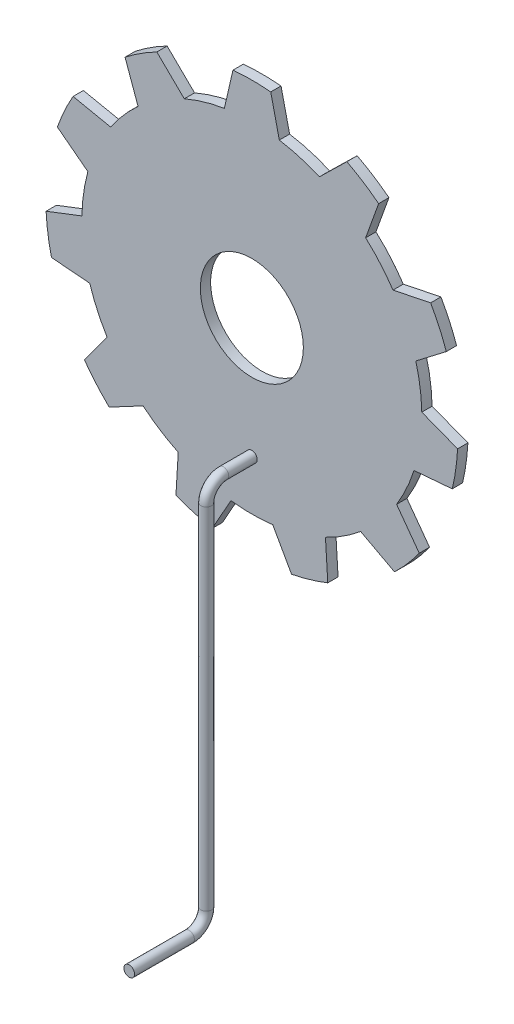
from build123d import *

# Parameters (mm, degrees)
SKETCH1_R           = 49.499915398
BASE_EXTRUDE_DEPTH  = 3
BOSS_EXTRUDE2_DEPTH = 3
CIRPATTERN3_COUNT   = 11
SKETCH9_R           = 15
CUT_EXTRUDE2_DEPTH  = 733
SKETCH11_R          = 1.560756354


with BuildPart() as part:
    # Sketch1 → Base-Extrude (new body)
    with BuildSketch(Plane.XY):
        Circle(SKETCH1_R)
    extrude(amount=BASE_EXTRUDE_DEPTH)

    # Sketch2 → Boss-Extrude2 (add, through all)
    with BuildSketch(Plane.XY.offset(3)):
        with BuildLine():
            Line((-8, 48.849172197), (-5.5, 59.74738488))
            ThreePointArc((-5.5, 59.74738488), (0, 60), (5.5, 59.74738488))
            Line((5.5, 59.74738488), (8, 48.849172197))
            ThreePointArc((8, 48.849172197), (0, 49.499915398), (-8, 48.849172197))
        make_face()
    boss_extrude2 = extrude(amount=-BOSS_EXTRUDE2_DEPTH)

    # CirPattern3: Boss-Extrude2 ×11 about axis
    cirpattern3_axis = Axis((0, 0, 0), (0, 0, 1))
    for i in range(1, CIRPATTERN3_COUNT):
        add(boss_extrude2.rotate(cirpattern3_axis, i * 360 / CIRPATTERN3_COUNT))

    # Sketch9 → Cut-Extrude2 (cut)
    with BuildSketch(Plane.XY.offset(3)):
        Circle(SKETCH9_R)
    extrude(amount=-CUT_EXTRUDE2_DEPTH, mode=Mode.SUBTRACT)

    # Boss-Sweep1: sweep along a path in Sketch10
    with BuildLine(Plane(origin=(0, 0, 0), x_dir=(0, 0, -1), z_dir=(1, 0, 0))) as boss_sweep1_path:
        Line((0, -34.969593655), (-11.284203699, -34.969593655))
        ThreePointArc((-11.284203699, -34.969593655), (-14.819737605, -36.434059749), (-16.284203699, -39.969593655))
        Line((-16.284203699, -39.969593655), (-16.284203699, -141.889002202))
        ThreePointArc((-16.284203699, -141.889002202), (-17.748669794, -145.424536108), (-21.284203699, -146.889002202))
        Line((-21.284203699, -146.889002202), (-38.710364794, -146.889002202))
    # Sketch11 → Boss-Sweep1 (sweep)
    with BuildSketch(Plane(origin=(0, 0, 0), x_dir=(-1, 0, 0), z_dir=(0, 0, -1))):
        with Locations((0, -34.969593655)):
            Circle(SKETCH11_R)
    sweep(path=boss_sweep1_path.line)


solid = part.part
